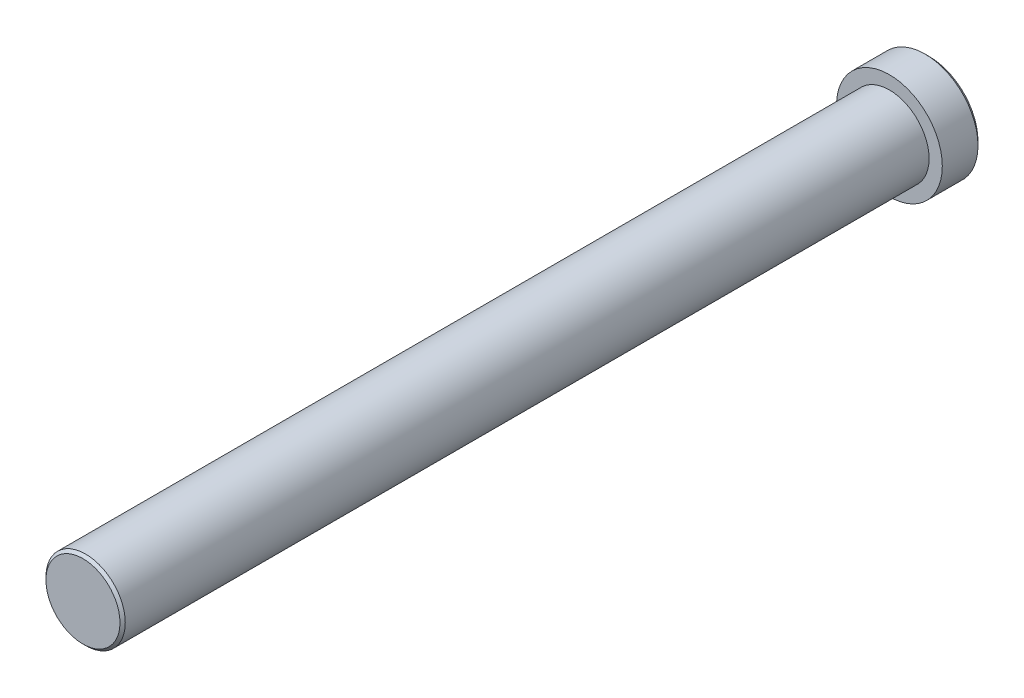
from build123d import *

# Parameters (mm, degrees)
SKETCH_1_R          = 2
EXTRUDE_1_DEPTH     = 33
SKETCH_2_OUTSIDE_W  = 12.696
SKETCH_2_OUTSIDE_H  = 12.696
SKETCH_2_OUTSIDE_R  = 1.5
CUT_EXTRUDE_1_DEPTH = 31.5
CUT_EXTRUDE_2_DEPTH = 1
CHAMFER_1_SIZE      = 0.15
CHAMFER_2_SIZE      = 0.1
SKETCH_4_R          = 1.5
CUT_EXTRUDE_3_DEPTH = 1
CHAMFER_3_SIZE      = 0.1


with BuildPart() as part:
    # Sketch 1 → Extrude 1 (new body)
    with BuildSketch(Plane.XY):
        Circle(SKETCH_1_R)
    extrude(amount=EXTRUDE_1_DEPTH)

    # Sketch 2 outside → Cut-Extrude 1 (cut)
    with BuildSketch(Plane.XY.offset(33)):
        Rectangle(SKETCH_2_OUTSIDE_W, SKETCH_2_OUTSIDE_H)
        Circle(SKETCH_2_OUTSIDE_R, mode=Mode.SUBTRACT)
    extrude(amount=-CUT_EXTRUDE_1_DEPTH, mode=Mode.SUBTRACT)

    # Sketch 3 → Cut-Extrude 2 (cut)
    with BuildSketch(Plane(origin=(0, 0, 0), x_dir=(-1, 0, 0), z_dir=(0, 0, -1))):
        Polygon((-0.5, 0.5), (-1.5, 0.5), (-1.5, -0.5), (-0.5, -0.5), (-0.5, -1.5), (0.5, -1.5), (0.5, -0.5), (1.5, -0.5), (1.5, 0.5), (0.5, 0.5), (0.5, 1.5), (-0.5, 1.5), align=None)
    extrude(amount=-CUT_EXTRUDE_2_DEPTH, mode=Mode.SUBTRACT)

    # Chamfer 1
    chamfer_1_edges = [part.edges().sort_by_distance(p)[0] for p in [
        (-2, 0, 0),
    ]]
    chamfer(chamfer_1_edges, length=CHAMFER_1_SIZE)

    # Chamfer 2
    chamfer_2_edges = [part.edges().sort_by_distance(p)[0] for p in [
        (-1.5, 0, 33),
    ]]
    chamfer(chamfer_2_edges, length=CHAMFER_2_SIZE)

    # Sketch 4 → Cut-Extrude 3 (cut)
    with BuildSketch(Plane.XY.offset(33)):
        Circle(SKETCH_4_R)
    extrude(amount=-CUT_EXTRUDE_3_DEPTH, mode=Mode.SUBTRACT)

    # Chamfer 3
    chamfer_3_edges = [part.edges().sort_by_distance(p)[0] for p in [
        (-1.5, 0, 32),
    ]]
    chamfer(chamfer_3_edges, length=CHAMFER_3_SIZE)


solid = part.part
